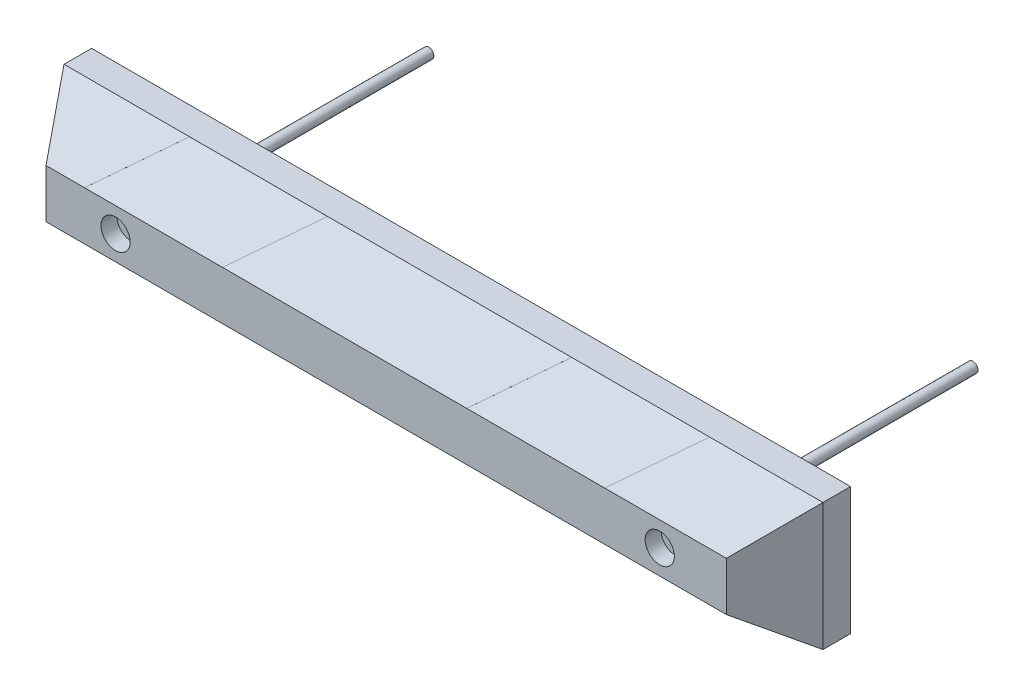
ISO-10303-21;
HEADER;
FILE_DESCRIPTION(('STEP AP214'),'2;1');
FILE_NAME('part.step','',(''),(''),'','','');
FILE_SCHEMA(('AUTOMOTIVE_DESIGN { 1 0 10303 214 1 1 1 1 }'));
ENDSEC;
DATA;
#1=APPLICATION_CONTEXT('core data for automotive mechanical design processes');
#2=APPLICATION_PROTOCOL_DEFINITION('international standard','automotive_design',2000,#1);
#3=PRODUCT_CONTEXT('',#1,'mechanical');
#4=PRODUCT('Part','Part','',(#3));
#5=PRODUCT_RELATED_PRODUCT_CATEGORY('part','',(#4));
#6=PRODUCT_DEFINITION_FORMATION('','',#4);
#7=PRODUCT_DEFINITION_CONTEXT('part definition',#1,'design');
#8=PRODUCT_DEFINITION('design','',#6,#7);
#9=PRODUCT_DEFINITION_SHAPE('','',#8);
#10=(LENGTH_UNIT() NAMED_UNIT(*) SI_UNIT(.MILLI.,.METRE.));
#11=(NAMED_UNIT(*) PLANE_ANGLE_UNIT() SI_UNIT($,.RADIAN.));
#12=(NAMED_UNIT(*) SI_UNIT($,.STERADIAN.) SOLID_ANGLE_UNIT());
#13=UNCERTAINTY_MEASURE_WITH_UNIT(LENGTH_MEASURE(1.E-05),#10,'distance_accuracy_value','');
#14=(GEOMETRIC_REPRESENTATION_CONTEXT(3) GLOBAL_UNCERTAINTY_ASSIGNED_CONTEXT((#13)) GLOBAL_UNIT_ASSIGNED_CONTEXT((#10,
#11,#12)) REPRESENTATION_CONTEXT('',''));
#15=CARTESIAN_POINT('',(0.,0.,0.));
#16=DIRECTION('',(0.,0.,1.));
#17=DIRECTION('',(1.,0.,0.));
#18=AXIS2_PLACEMENT_3D('',#15,#16,#17);
#19=CARTESIAN_POINT('',(0.,0.,0.));
#20=DIRECTION('',(0.,0.,1.));
#21=DIRECTION('',(1.,0.,0.));
#22=AXIS2_PLACEMENT_3D('',#19,#20,#21);
#23=PLANE('',#22);
#24=CARTESIAN_POINT('',(-323.723,0.,0.));
#25=DIRECTION('',(0.,0.,1.));
#26=DIRECTION('',(1.,0.,0.));
#27=AXIS2_PLACEMENT_3D('',#24,#25,#26);
#28=CIRCLE('',#27,16.7448960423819);
#29=CARTESIAN_POINT('',(-306.978103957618,0.,0.));
#30=VERTEX_POINT('',#29);
#31=EDGE_CURVE('E405',#30,#30,#28,.F.);
#32=ORIENTED_EDGE('',*,*,#31,.F.);
#33=EDGE_LOOP('',(#32));
#34=FACE_BOUND('',#33,.T.);
#35=DIRECTION('',(0.,-1.,0.));
#36=VECTOR('',#35,1.);
#37=CARTESIAN_POINT('',(-454.025,76.2,0.));
#38=LINE('',#37,#36);
#39=CARTESIAN_POINT('',(-454.025,76.2,0.));
#40=VERTEX_POINT('',#39);
#41=CARTESIAN_POINT('',(-454.025,-76.2,0.));
#42=VERTEX_POINT('',#41);
#43=EDGE_CURVE('E345',#40,#42,#38,.T.);
#44=ORIENTED_EDGE('',*,*,#43,.F.);
#45=DIRECTION('',(-1.,0.,0.));
#46=VECTOR('',#45,1.);
#47=CARTESIAN_POINT('',(-454.025,76.2,0.));
#48=LINE('',#47,#46);
#49=CARTESIAN_POINT('',(454.025,76.2,0.));
#50=VERTEX_POINT('',#49);
#51=EDGE_CURVE('E373',#50,#40,#48,.T.);
#52=ORIENTED_EDGE('',*,*,#51,.F.);
#53=DIRECTION('',(0.,1.,0.));
#54=VECTOR('',#53,1.);
#55=CARTESIAN_POINT('',(454.025,76.2,0.));
#56=LINE('',#55,#54);
#57=CARTESIAN_POINT('',(454.025,-76.2,0.));
#58=VERTEX_POINT('',#57);
#59=EDGE_CURVE('E391',#58,#50,#56,.T.);
#60=ORIENTED_EDGE('',*,*,#59,.F.);
#61=DIRECTION('',(1.,0.,0.));
#62=VECTOR('',#61,1.);
#63=CARTESIAN_POINT('',(-454.025,-76.2,0.));
#64=LINE('',#63,#62);
#65=EDGE_CURVE('E389',#42,#58,#64,.T.);
#66=ORIENTED_EDGE('',*,*,#65,.F.);
#67=EDGE_LOOP('',(#44,#52,#60,#66));
#68=FACE_BOUND('',#67,.T.);
#69=CARTESIAN_POINT('',(327.279,0.,0.));
#70=DIRECTION('',(0.,0.,1.));
#71=DIRECTION('',(1.,0.,0.));
#72=AXIS2_PLACEMENT_3D('',#69,#70,#71);
#73=CIRCLE('',#72,16.7448960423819);
#74=CARTESIAN_POINT('',(344.023896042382,0.,0.));
#75=VERTEX_POINT('',#74);
#76=EDGE_CURVE('E411',#75,#75,#73,.F.);
#77=ORIENTED_EDGE('',*,*,#76,.F.);
#78=EDGE_LOOP('',(#77));
#79=FACE_BOUND('',#78,.T.);
#80=ADVANCED_FACE('F35',(#34,#68,#79),#23,.F.);
#81=CARTESIAN_POINT('',(-454.025,76.2,33.02));
#82=DIRECTION('',(0.,0.824620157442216,0.565686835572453));
#83=DIRECTION('',(0.,-0.565686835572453,0.824620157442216));
#84=AXIS2_PLACEMENT_3D('',#81,#82,#83);
#85=PLANE('',#84);
#86=DIRECTION('',(-0.56568683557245,-0.466476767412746,0.679998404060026));
#87=VECTOR('',#86,1.);
#88=CARTESIAN_POINT('',(261.428614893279,29.1543356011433,101.6));
#89=LINE('',#88,#87);
#90=CARTESIAN_POINT('',(318.479929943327,76.2,33.02));
#91=VERTEX_POINT('',#90);
#92=CARTESIAN_POINT('',(261.428614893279,29.1543356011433,101.6));
#93=VERTEX_POINT('',#92);
#94=EDGE_CURVE('E208',#91,#93,#89,.T.);
#95=ORIENTED_EDGE('',*,*,#94,.T.);
#96=DIRECTION('',(1.,0.,0.));
#97=VECTOR('',#96,1.);
#98=CARTESIAN_POINT('',(-454.025,29.1543356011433,101.6));
#99=LINE('',#98,#97);
#100=CARTESIAN_POINT('',(406.979335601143,29.1543356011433,101.6));
#101=VERTEX_POINT('',#100);
#102=EDGE_CURVE('E351',#101,#93,#99,.F.);
#103=ORIENTED_EDGE('',*,*,#102,.F.);
#104=DIRECTION('',(0.492366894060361,0.492366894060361,-0.717739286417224));
#105=VECTOR('',#104,1.);
#106=CARTESIAN_POINT('',(233.890834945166,-143.934165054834,353.91675493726));
#107=LINE('',#106,#105);
#108=CARTESIAN_POINT('',(454.025,76.2,33.02));
#109=VERTEX_POINT('',#108);
#110=EDGE_CURVE('E350',#101,#109,#107,.T.);
#111=ORIENTED_EDGE('',*,*,#110,.T.);
#112=DIRECTION('',(-1.,0.,0.));
#113=VECTOR('',#112,1.);
#114=CARTESIAN_POINT('',(-454.025,76.2,33.02));
#115=LINE('',#114,#113);
#116=EDGE_CURVE('E382',#109,#91,#115,.T.);
#117=ORIENTED_EDGE('',*,*,#116,.T.);
#118=EDGE_LOOP('',(#95,#103,#111,#117));
#119=FACE_BOUND('',#118,.T.);
#120=ADVANCED_FACE('F451',(#119),#85,.T.);
#121=DIRECTION('',(0.565686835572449,0.466476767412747,-0.679998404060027));
#122=VECTOR('',#121,1.);
#123=CARTESIAN_POINT('',(96.3286148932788,29.1543356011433,101.6));
#124=LINE('',#123,#122);
#125=CARTESIAN_POINT('',(96.3286148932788,29.1543356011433,101.6));
#126=VERTEX_POINT('',#125);
#127=CARTESIAN_POINT('',(153.379929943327,76.2,33.02));
#128=VERTEX_POINT('',#127);
#129=EDGE_CURVE('E51',#126,#128,#124,.T.);
#130=ORIENTED_EDGE('',*,*,#129,.T.);
#131=CARTESIAN_POINT('',(-138.720070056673,76.2,33.02));
#132=VERTEX_POINT('',#131);
#133=EDGE_CURVE('E386',#128,#132,#115,.T.);
#134=ORIENTED_EDGE('',*,*,#133,.T.);
#135=DIRECTION('',(-0.565686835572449,-0.466476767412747,0.679998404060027));
#136=VECTOR('',#135,1.);
#137=CARTESIAN_POINT('',(-195.771385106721,29.1543356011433,101.6));
#138=LINE('',#137,#136);
#139=CARTESIAN_POINT('',(-195.771385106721,29.1543356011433,101.6));
#140=VERTEX_POINT('',#139);
#141=EDGE_CURVE('E243',#132,#140,#138,.T.);
#142=ORIENTED_EDGE('',*,*,#141,.T.);
#143=EDGE_CURVE('E368',#126,#140,#99,.F.);
#144=ORIENTED_EDGE('',*,*,#143,.F.);
#145=EDGE_LOOP('',(#130,#134,#142,#144));
#146=FACE_BOUND('',#145,.T.);
#147=ADVANCED_FACE('F457',(#146),#85,.T.);
#148=DIRECTION('',(0.565686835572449,0.466476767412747,-0.679998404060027));
#149=VECTOR('',#148,1.);
#150=CARTESIAN_POINT('',(-303.820070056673,76.2,33.02));
#151=LINE('',#150,#149);
#152=CARTESIAN_POINT('',(-360.871385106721,29.1543356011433,101.6));
#153=VERTEX_POINT('',#152);
#154=CARTESIAN_POINT('',(-303.820070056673,76.2,33.02));
#155=VERTEX_POINT('',#154);
#156=EDGE_CURVE('E59',#153,#155,#151,.T.);
#157=ORIENTED_EDGE('',*,*,#156,.T.);
#158=CARTESIAN_POINT('',(-454.025,76.2,33.02));
#159=VERTEX_POINT('',#158);
#160=EDGE_CURVE('E381',#155,#159,#115,.T.);
#161=ORIENTED_EDGE('',*,*,#160,.T.);
#162=DIRECTION('',(-0.492366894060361,0.492366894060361,-0.717739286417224));
#163=VECTOR('',#162,1.);
#164=CARTESIAN_POINT('',(-454.025,76.2,33.02));
#165=LINE('',#164,#163);
#166=CARTESIAN_POINT('',(-406.979335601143,29.1543356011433,101.6));
#167=VERTEX_POINT('',#166);
#168=EDGE_CURVE('E347',#167,#159,#165,.T.);
#169=ORIENTED_EDGE('',*,*,#168,.F.);
#170=EDGE_CURVE('E365',#153,#167,#99,.F.);
#171=ORIENTED_EDGE('',*,*,#170,.F.);
#172=EDGE_LOOP('',(#157,#161,#169,#171));
#173=FACE_BOUND('',#172,.T.);
#174=ADVANCED_FACE('F460',(#173),#85,.T.);
#175=CARTESIAN_POINT('',(-454.025,-76.2,33.02));
#176=DIRECTION('',(0.,-0.824620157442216,0.565686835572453));
#177=DIRECTION('',(0.,-0.565686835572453,-0.824620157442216));
#178=AXIS2_PLACEMENT_3D('',#175,#176,#177);
#179=PLANE('',#178);
#180=DIRECTION('',(1.,0.,0.));
#181=VECTOR('',#180,1.);
#182=CARTESIAN_POINT('',(-454.025,-76.2,33.02));
#183=LINE('',#182,#181);
#184=CARTESIAN_POINT('',(-138.720070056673,-76.2,33.02));
#185=VERTEX_POINT('',#184);
#186=CARTESIAN_POINT('',(153.379929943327,-76.2,33.02));
#187=VERTEX_POINT('',#186);
#188=EDGE_CURVE('E378',#185,#187,#183,.T.);
#189=ORIENTED_EDGE('',*,*,#188,.T.);
#190=DIRECTION('',(0.565686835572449,-0.466476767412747,-0.679998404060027));
#191=VECTOR('',#190,1.);
#192=CARTESIAN_POINT('',(96.3286148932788,-29.1543356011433,101.6));
#193=LINE('',#192,#191);
#194=CARTESIAN_POINT('',(96.3286148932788,-29.1543356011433,101.6));
#195=VERTEX_POINT('',#194);
#196=EDGE_CURVE('E262',#195,#187,#193,.T.);
#197=ORIENTED_EDGE('',*,*,#196,.F.);
#198=DIRECTION('',(-1.,0.,0.));
#199=VECTOR('',#198,1.);
#200=CARTESIAN_POINT('',(-454.025,-29.1543356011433,101.6));
#201=LINE('',#200,#199);
#202=CARTESIAN_POINT('',(-195.771385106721,-29.1543356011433,101.6));
#203=VERTEX_POINT('',#202);
#204=EDGE_CURVE('E363',#203,#195,#201,.F.);
#205=ORIENTED_EDGE('',*,*,#204,.F.);
#206=DIRECTION('',(-0.565686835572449,0.466476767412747,0.679998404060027));
#207=VECTOR('',#206,1.);
#208=CARTESIAN_POINT('',(-195.771385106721,-29.1543356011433,101.6));
#209=LINE('',#208,#207);
#210=EDGE_CURVE('E309',#185,#203,#209,.T.);
#211=ORIENTED_EDGE('',*,*,#210,.F.);
#212=EDGE_LOOP('',(#189,#197,#205,#211));
#213=FACE_BOUND('',#212,.T.);
#214=ADVANCED_FACE('F541',(#213),#179,.T.);
#215=CARTESIAN_POINT('',(-454.025,-76.2,33.02));
#216=VERTEX_POINT('',#215);
#217=CARTESIAN_POINT('',(-303.820070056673,-76.2,33.02));
#218=VERTEX_POINT('',#217);
#219=EDGE_CURVE('E374',#216,#218,#183,.T.);
#220=ORIENTED_EDGE('',*,*,#219,.T.);
#221=DIRECTION('',(0.565686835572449,-0.466476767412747,-0.679998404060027));
#222=VECTOR('',#221,1.);
#223=CARTESIAN_POINT('',(-303.820070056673,-76.2,33.02));
#224=LINE('',#223,#222);
#225=CARTESIAN_POINT('',(-360.871385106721,-29.1543356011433,101.6));
#226=VERTEX_POINT('',#225);
#227=EDGE_CURVE('E283',#226,#218,#224,.T.);
#228=ORIENTED_EDGE('',*,*,#227,.F.);
#229=CARTESIAN_POINT('',(-406.979335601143,-29.1543356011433,101.6));
#230=VERTEX_POINT('',#229);
#231=EDGE_CURVE('E359',#230,#226,#201,.F.);
#232=ORIENTED_EDGE('',*,*,#231,.F.);
#233=DIRECTION('',(-0.492366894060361,-0.492366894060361,-0.717739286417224));
#234=VECTOR('',#233,1.);
#235=CARTESIAN_POINT('',(-454.025,-76.2,33.02));
#236=LINE('',#235,#234);
#237=EDGE_CURVE('E342',#230,#216,#236,.T.);
#238=ORIENTED_EDGE('',*,*,#237,.T.);
#239=EDGE_LOOP('',(#220,#228,#232,#238));
#240=FACE_BOUND('',#239,.T.);
#241=ADVANCED_FACE('F562',(#240),#179,.T.);
#242=CARTESIAN_POINT('',(327.279,0.,0.));
#243=DIRECTION('',(0.,0.,1.));
#244=DIRECTION('',(1.,0.,0.));
#245=AXIS2_PLACEMENT_3D('',#242,#243,#244);
#246=CYLINDRICAL_SURFACE('',#245,7.93749999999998);
#247=CARTESIAN_POINT('',(327.279,0.,0.));
#248=DIRECTION('',(0.,0.,1.));
#249=DIRECTION('',(1.,0.,0.));
#250=AXIS2_PLACEMENT_3D('',#247,#248,#249);
#251=CIRCLE('',#250,7.93749999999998);
#252=CARTESIAN_POINT('',(335.2165,0.,0.));
#253=VERTEX_POINT('',#252);
#254=EDGE_CURVE('E335',#253,#253,#251,.T.);
#255=ORIENTED_EDGE('',*,*,#254,.F.);
#256=EDGE_LOOP('',(#255));
#257=FACE_BOUND('',#256,.T.);
#258=CARTESIAN_POINT('',(327.279,0.,82.55));
#259=DIRECTION('',(0.,0.,1.));
#260=DIRECTION('',(1.,0.,0.));
#261=AXIS2_PLACEMENT_3D('',#258,#259,#260);
#262=CIRCLE('',#261,7.93749999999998);
#263=CARTESIAN_POINT('',(335.2165,0.,82.55));
#264=VERTEX_POINT('',#263);
#265=EDGE_CURVE('E325',#264,#264,#262,.F.);
#266=ORIENTED_EDGE('',*,*,#265,.F.);
#267=EDGE_LOOP('',(#266));
#268=FACE_BOUND('',#267,.T.);
#269=ADVANCED_FACE('F601',(#257,#268),#246,.F.);
#270=CARTESIAN_POINT('',(-323.723,0.,0.));
#271=DIRECTION('',(0.,0.,1.));
#272=DIRECTION('',(1.,0.,0.));
#273=AXIS2_PLACEMENT_3D('',#270,#271,#272);
#274=CYLINDRICAL_SURFACE('',#273,7.9375000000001);
#275=CARTESIAN_POINT('',(-323.723,0.,0.));
#276=DIRECTION('',(0.,0.,1.));
#277=DIRECTION('',(1.,0.,0.));
#278=AXIS2_PLACEMENT_3D('',#275,#276,#277);
#279=CIRCLE('',#278,7.9375000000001);
#280=CARTESIAN_POINT('',(-315.7855,0.,0.));
#281=VERTEX_POINT('',#280);
#282=EDGE_CURVE('E338',#281,#281,#279,.T.);
#283=ORIENTED_EDGE('',*,*,#282,.F.);
#284=EDGE_LOOP('',(#283));
#285=FACE_BOUND('',#284,.T.);
#286=CARTESIAN_POINT('',(-323.723,0.,82.55));
#287=DIRECTION('',(0.,0.,1.));
#288=DIRECTION('',(1.,0.,0.));
#289=AXIS2_PLACEMENT_3D('',#286,#287,#288);
#290=CIRCLE('',#289,7.9375000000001);
#291=CARTESIAN_POINT('',(-315.7855,0.,82.55));
#292=VERTEX_POINT('',#291);
#293=EDGE_CURVE('E331',#292,#292,#290,.F.);
#294=ORIENTED_EDGE('',*,*,#293,.F.);
#295=EDGE_LOOP('',(#294));
#296=FACE_BOUND('',#295,.T.);
#297=ADVANCED_FACE('F481',(#285,#296),#274,.F.);
#298=CARTESIAN_POINT('',(-454.025,76.2,33.02));
#299=DIRECTION('',(1.,0.,0.));
#300=DIRECTION('',(0.,0.,-1.));
#301=AXIS2_PLACEMENT_3D('',#298,#299,#300);
#302=PLANE('',#301);
#303=ORIENTED_EDGE('',*,*,#43,.T.);
#304=DIRECTION('',(0.,0.,-1.));
#305=VECTOR('',#304,1.);
#306=CARTESIAN_POINT('',(-454.025,-76.2,33.02));
#307=LINE('',#306,#305);
#308=EDGE_CURVE('E402',#216,#42,#307,.T.);
#309=ORIENTED_EDGE('',*,*,#308,.F.);
#310=DIRECTION('',(0.,-1.,0.));
#311=VECTOR('',#310,1.);
#312=CARTESIAN_POINT('',(-454.025,76.2,33.02));
#313=LINE('',#312,#311);
#314=EDGE_CURVE('E369',#159,#216,#313,.T.);
#315=ORIENTED_EDGE('',*,*,#314,.F.);
#316=DIRECTION('',(0.,0.,-1.));
#317=VECTOR('',#316,1.);
#318=CARTESIAN_POINT('',(-454.025,76.2,33.02));
#319=LINE('',#318,#317);
#320=EDGE_CURVE('E385',#159,#40,#319,.T.);
#321=ORIENTED_EDGE('',*,*,#320,.T.);
#322=EDGE_LOOP('',(#303,#309,#315,#321));
#323=FACE_BOUND('',#322,.T.);
#324=ADVANCED_FACE('F37',(#323),#302,.F.);
#325=CARTESIAN_POINT('',(-454.025,-76.2,33.02));
#326=DIRECTION('',(0.,1.,0.));
#327=DIRECTION('',(0.,0.,1.));
#328=AXIS2_PLACEMENT_3D('',#325,#326,#327);
#329=PLANE('',#328);
#330=ORIENTED_EDGE('',*,*,#65,.T.);
#331=DIRECTION('',(0.,0.,-1.));
#332=VECTOR('',#331,1.);
#333=CARTESIAN_POINT('',(454.025,-76.2,33.02));
#334=LINE('',#333,#332);
#335=CARTESIAN_POINT('',(454.025,-76.2,33.02));
#336=VERTEX_POINT('',#335);
#337=EDGE_CURVE('E399',#336,#58,#334,.T.);
#338=ORIENTED_EDGE('',*,*,#337,.F.);
#339=CARTESIAN_POINT('',(318.479929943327,-76.2,33.02));
#340=VERTEX_POINT('',#339);
#341=EDGE_CURVE('E372',#340,#336,#183,.T.);
#342=ORIENTED_EDGE('',*,*,#341,.F.);
#343=DIRECTION('',(1.,0.,0.));
#344=VECTOR('',#343,1.);
#345=CARTESIAN_POINT('',(318.479929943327,-76.2,33.02));
#346=LINE('',#345,#344);
#347=EDGE_CURVE('E250',#187,#340,#346,.T.);
#348=ORIENTED_EDGE('',*,*,#347,.F.);
#349=ORIENTED_EDGE('',*,*,#188,.F.);
#350=DIRECTION('',(1.,0.,0.));
#351=VECTOR('',#350,1.);
#352=CARTESIAN_POINT('',(-138.720070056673,-76.2,33.02));
#353=LINE('',#352,#351);
#354=EDGE_CURVE('E306',#218,#185,#353,.T.);
#355=ORIENTED_EDGE('',*,*,#354,.F.);
#356=ORIENTED_EDGE('',*,*,#219,.F.);
#357=ORIENTED_EDGE('',*,*,#308,.T.);
#358=EDGE_LOOP('',(#330,#338,#342,#348,#349,#355,#356,#357));
#359=FACE_BOUND('',#358,.T.);
#360=ADVANCED_FACE('F474',(#359),#329,.F.);
#361=CARTESIAN_POINT('',(454.025,76.2,33.02));
#362=DIRECTION('',(-1.,0.,0.));
#363=DIRECTION('',(0.,0.,1.));
#364=AXIS2_PLACEMENT_3D('',#361,#362,#363);
#365=PLANE('',#364);
#366=ORIENTED_EDGE('',*,*,#59,.T.);
#367=DIRECTION('',(0.,0.,-1.));
#368=VECTOR('',#367,1.);
#369=CARTESIAN_POINT('',(454.025,76.2,33.02));
#370=LINE('',#369,#368);
#371=EDGE_CURVE('E396',#109,#50,#370,.T.);
#372=ORIENTED_EDGE('',*,*,#371,.F.);
#373=DIRECTION('',(0.,1.,0.));
#374=VECTOR('',#373,1.);
#375=CARTESIAN_POINT('',(454.025,76.2,33.02));
#376=LINE('',#375,#374);
#377=EDGE_CURVE('E377',#336,#109,#376,.T.);
#378=ORIENTED_EDGE('',*,*,#377,.F.);
#379=ORIENTED_EDGE('',*,*,#337,.T.);
#380=EDGE_LOOP('',(#366,#372,#378,#379));
#381=FACE_BOUND('',#380,.T.);
#382=ADVANCED_FACE('F471',(#381),#365,.F.);
#383=CARTESIAN_POINT('',(-454.025,76.2,33.02));
#384=DIRECTION('',(0.,-1.,0.));
#385=DIRECTION('',(0.,0.,-1.));
#386=AXIS2_PLACEMENT_3D('',#383,#384,#385);
#387=PLANE('',#386);
#388=ORIENTED_EDGE('',*,*,#51,.T.);
#389=ORIENTED_EDGE('',*,*,#320,.F.);
#390=ORIENTED_EDGE('',*,*,#160,.F.);
#391=DIRECTION('',(1.,0.,0.));
#392=VECTOR('',#391,1.);
#393=CARTESIAN_POINT('',(-138.720070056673,76.2,33.02));
#394=LINE('',#393,#392);
#395=EDGE_CURVE('E232',#155,#132,#394,.T.);
#396=ORIENTED_EDGE('',*,*,#395,.T.);
#397=ORIENTED_EDGE('',*,*,#133,.F.);
#398=DIRECTION('',(1.,0.,0.));
#399=VECTOR('',#398,1.);
#400=CARTESIAN_POINT('',(318.479929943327,76.2,33.02));
#401=LINE('',#400,#399);
#402=EDGE_CURVE('E204',#128,#91,#401,.T.);
#403=ORIENTED_EDGE('',*,*,#402,.T.);
#404=ORIENTED_EDGE('',*,*,#116,.F.);
#405=ORIENTED_EDGE('',*,*,#371,.T.);
#406=EDGE_LOOP('',(#388,#389,#390,#396,#397,#403,#404,#405));
#407=FACE_BOUND('',#406,.T.);
#408=ADVANCED_FACE('F467',(#407),#387,.F.);
#409=CARTESIAN_POINT('',(-454.025,76.2,33.02));
#410=DIRECTION('',(-0.824620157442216,0.,0.565686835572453));
#411=DIRECTION('',(0.565686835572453,0.,0.824620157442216));
#412=AXIS2_PLACEMENT_3D('',#409,#410,#411);
#413=PLANE('',#412);
#414=ORIENTED_EDGE('',*,*,#314,.T.);
#415=ORIENTED_EDGE('',*,*,#237,.F.);
#416=DIRECTION('',(0.,1.,0.));
#417=VECTOR('',#416,1.);
#418=CARTESIAN_POINT('',(-406.979335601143,76.2,101.6));
#419=LINE('',#418,#417);
#420=EDGE_CURVE('E341',#167,#230,#419,.F.);
#421=ORIENTED_EDGE('',*,*,#420,.F.);
#422=ORIENTED_EDGE('',*,*,#168,.T.);
#423=EDGE_LOOP('',(#414,#415,#421,#422));
#424=FACE_BOUND('',#423,.T.);
#425=ADVANCED_FACE('F470',(#424),#413,.T.);
#426=CARTESIAN_POINT('',(261.428614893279,-29.1543356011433,101.6));
#427=VERTEX_POINT('',#426);
#428=CARTESIAN_POINT('',(406.979335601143,-29.1543356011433,101.6));
#429=VERTEX_POINT('',#428);
#430=EDGE_CURVE('E358',#427,#429,#201,.F.);
#431=ORIENTED_EDGE('',*,*,#430,.F.);
#432=DIRECTION('',(-0.56568683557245,0.466476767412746,0.679998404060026));
#433=VECTOR('',#432,1.);
#434=CARTESIAN_POINT('',(261.428614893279,-29.1543356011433,101.6));
#435=LINE('',#434,#433);
#436=EDGE_CURVE('E274',#340,#427,#435,.T.);
#437=ORIENTED_EDGE('',*,*,#436,.F.);
#438=ORIENTED_EDGE('',*,*,#341,.T.);
#439=DIRECTION('',(0.492366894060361,-0.492366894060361,-0.717739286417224));
#440=VECTOR('',#439,1.);
#441=CARTESIAN_POINT('',(417.079405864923,-39.254405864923,86.8767980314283));
#442=LINE('',#441,#440);
#443=EDGE_CURVE('E346',#429,#336,#442,.T.);
#444=ORIENTED_EDGE('',*,*,#443,.F.);
#445=EDGE_LOOP('',(#431,#437,#438,#444));
#446=FACE_BOUND('',#445,.T.);
#447=ADVANCED_FACE('F465',(#446),#179,.T.);
#448=CARTESIAN_POINT('',(454.025,76.2,33.02));
#449=DIRECTION('',(0.824620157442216,0.,0.565686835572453));
#450=DIRECTION('',(0.565686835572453,0.,-0.824620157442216));
#451=AXIS2_PLACEMENT_3D('',#448,#449,#450);
#452=PLANE('',#451);
#453=ORIENTED_EDGE('',*,*,#377,.T.);
#454=ORIENTED_EDGE('',*,*,#110,.F.);
#455=DIRECTION('',(0.,-1.,0.));
#456=VECTOR('',#455,1.);
#457=CARTESIAN_POINT('',(406.979335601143,76.2,101.6));
#458=LINE('',#457,#456);
#459=EDGE_CURVE('E362',#429,#101,#458,.F.);
#460=ORIENTED_EDGE('',*,*,#459,.F.);
#461=ORIENTED_EDGE('',*,*,#443,.T.);
#462=EDGE_LOOP('',(#453,#454,#460,#461));
#463=FACE_BOUND('',#462,.T.);
#464=ADVANCED_FACE('F528',(#463),#452,.T.);
#465=CARTESIAN_POINT('',(0.,0.,101.6));
#466=DIRECTION('',(0.,0.,1.));
#467=DIRECTION('',(1.,0.,0.));
#468=AXIS2_PLACEMENT_3D('',#465,#466,#467);
#469=PLANE('',#468);
#470=CARTESIAN_POINT('',(327.279,0.,101.6));
#471=DIRECTION('',(0.,0.,1.));
#472=DIRECTION('',(1.,0.,0.));
#473=AXIS2_PLACEMENT_3D('',#470,#471,#472);
#474=CIRCLE('',#473,17.4625);
#475=CARTESIAN_POINT('',(344.7415,0.,101.6));
#476=VERTEX_POINT('',#475);
#477=EDGE_CURVE('E315',#476,#476,#474,.T.);
#478=ORIENTED_EDGE('',*,*,#477,.F.);
#479=EDGE_LOOP('',(#478));
#480=FACE_BOUND('',#479,.T.);
#481=CARTESIAN_POINT('',(-323.723,0.,101.6));
#482=DIRECTION('',(0.,0.,1.));
#483=DIRECTION('',(1.,0.,0.));
#484=AXIS2_PLACEMENT_3D('',#481,#482,#483);
#485=CIRCLE('',#484,17.4625);
#486=CARTESIAN_POINT('',(-306.2605,0.,101.6));
#487=VERTEX_POINT('',#486);
#488=EDGE_CURVE('E332',#487,#487,#485,.T.);
#489=ORIENTED_EDGE('',*,*,#488,.F.);
#490=EDGE_LOOP('',(#489));
#491=FACE_BOUND('',#490,.T.);
#492=ORIENTED_EDGE('',*,*,#420,.T.);
#493=ORIENTED_EDGE('',*,*,#231,.T.);
#494=DIRECTION('',(-1.,0.,0.));
#495=VECTOR('',#494,1.);
#496=CARTESIAN_POINT('',(-360.871385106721,-29.1543356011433,101.6));
#497=LINE('',#496,#495);
#498=EDGE_CURVE('E294',#203,#226,#497,.T.);
#499=ORIENTED_EDGE('',*,*,#498,.F.);
#500=ORIENTED_EDGE('',*,*,#204,.T.);
#501=DIRECTION('',(-1.,0.,0.));
#502=VECTOR('',#501,1.);
#503=CARTESIAN_POINT('',(96.3286148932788,-29.1543356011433,101.6));
#504=LINE('',#503,#502);
#505=EDGE_CURVE('E276',#427,#195,#504,.T.);
#506=ORIENTED_EDGE('',*,*,#505,.F.);
#507=ORIENTED_EDGE('',*,*,#430,.T.);
#508=ORIENTED_EDGE('',*,*,#459,.T.);
#509=ORIENTED_EDGE('',*,*,#102,.T.);
#510=DIRECTION('',(-1.,0.,0.));
#511=VECTOR('',#510,1.);
#512=CARTESIAN_POINT('',(96.3286148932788,29.1543356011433,101.6));
#513=LINE('',#512,#511);
#514=EDGE_CURVE('E211',#93,#126,#513,.T.);
#515=ORIENTED_EDGE('',*,*,#514,.T.);
#516=ORIENTED_EDGE('',*,*,#143,.T.);
#517=DIRECTION('',(-1.,0.,0.));
#518=VECTOR('',#517,1.);
#519=CARTESIAN_POINT('',(-360.871385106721,29.1543356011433,101.6));
#520=LINE('',#519,#518);
#521=EDGE_CURVE('E240',#140,#153,#520,.T.);
#522=ORIENTED_EDGE('',*,*,#521,.T.);
#523=ORIENTED_EDGE('',*,*,#170,.T.);
#524=EDGE_LOOP('',(#492,#493,#499,#500,#506,#507,#508,#509,#515,#516,#522,#523));
#525=FACE_BOUND('',#524,.T.);
#526=ADVANCED_FACE('F518',(#480,#491,#525),#469,.T.);
#527=CARTESIAN_POINT('',(-323.723,0.,82.55));
#528=DIRECTION('',(0.,0.,1.));
#529=DIRECTION('',(1.,0.,0.));
#530=AXIS2_PLACEMENT_3D('',#527,#528,#529);
#531=PLANE('',#530);
#532=CARTESIAN_POINT('',(-323.723,0.,82.55));
#533=DIRECTION('',(0.,0.,1.));
#534=DIRECTION('',(1.,0.,0.));
#535=AXIS2_PLACEMENT_3D('',#532,#533,#534);
#536=CIRCLE('',#535,17.4625);
#537=CARTESIAN_POINT('',(-306.2605,0.,82.55));
#538=VERTEX_POINT('',#537);
#539=EDGE_CURVE('E328',#538,#538,#536,.T.);
#540=ORIENTED_EDGE('',*,*,#539,.T.);
#541=EDGE_LOOP('',(#540));
#542=FACE_BOUND('',#541,.T.);
#543=ORIENTED_EDGE('',*,*,#293,.T.);
#544=EDGE_LOOP('',(#543));
#545=FACE_BOUND('',#544,.T.);
#546=ADVANCED_FACE('F594',(#542,#545),#531,.T.);
#547=CARTESIAN_POINT('',(-323.723,0.,82.55));
#548=DIRECTION('',(0.,0.,1.));
#549=DIRECTION('',(1.,0.,0.));
#550=AXIS2_PLACEMENT_3D('',#547,#548,#549);
#551=CYLINDRICAL_SURFACE('',#550,17.4625);
#552=CARTESIAN_POINT('',(-306.2605,0.,82.55));
#553=CARTESIAN_POINT('',(-306.2605,0.,82.7484375));
#554=CARTESIAN_POINT('',(-306.2605,0.,82.946875));
#555=CARTESIAN_POINT('',(-306.2605,0.,83.34375));
#556=CARTESIAN_POINT('',(-306.2605,0.,83.5421875));
#557=CARTESIAN_POINT('',(-306.2605,0.,83.9390625));
#558=CARTESIAN_POINT('',(-306.2605,0.,84.1375));
#559=CARTESIAN_POINT('',(-306.2605,0.,84.534375));
#560=CARTESIAN_POINT('',(-306.2605,0.,84.7328125));
#561=CARTESIAN_POINT('',(-306.2605,0.,85.1296875));
#562=CARTESIAN_POINT('',(-306.2605,0.,85.328125));
#563=CARTESIAN_POINT('',(-306.2605,0.,85.725));
#564=CARTESIAN_POINT('',(-306.2605,0.,85.9234375));
#565=CARTESIAN_POINT('',(-306.2605,0.,86.3203125));
#566=CARTESIAN_POINT('',(-306.2605,0.,86.51875));
#567=CARTESIAN_POINT('',(-306.2605,0.,86.915625));
#568=CARTESIAN_POINT('',(-306.2605,0.,87.1140625));
#569=CARTESIAN_POINT('',(-306.2605,0.,87.5109375));
#570=CARTESIAN_POINT('',(-306.2605,0.,87.709375));
#571=CARTESIAN_POINT('',(-306.2605,0.,88.10625));
#572=CARTESIAN_POINT('',(-306.2605,0.,88.3046875));
#573=CARTESIAN_POINT('',(-306.2605,0.,88.7015625));
#574=CARTESIAN_POINT('',(-306.2605,0.,88.9));
#575=CARTESIAN_POINT('',(-306.2605,0.,89.296875));
#576=CARTESIAN_POINT('',(-306.2605,0.,89.4953125));
#577=CARTESIAN_POINT('',(-306.2605,0.,89.8921875));
#578=CARTESIAN_POINT('',(-306.2605,0.,90.090625));
#579=CARTESIAN_POINT('',(-306.2605,0.,90.4875));
#580=CARTESIAN_POINT('',(-306.2605,0.,90.6859375));
#581=CARTESIAN_POINT('',(-306.2605,0.,91.0828125));
#582=CARTESIAN_POINT('',(-306.2605,0.,91.28125));
#583=CARTESIAN_POINT('',(-306.2605,0.,91.678125));
#584=CARTESIAN_POINT('',(-306.2605,0.,91.8765625));
#585=CARTESIAN_POINT('',(-306.2605,0.,92.2734375));
#586=CARTESIAN_POINT('',(-306.2605,0.,92.471875));
#587=CARTESIAN_POINT('',(-306.2605,0.,92.86875));
#588=CARTESIAN_POINT('',(-306.2605,0.,93.0671875));
#589=CARTESIAN_POINT('',(-306.2605,0.,93.4640625));
#590=CARTESIAN_POINT('',(-306.2605,0.,93.6625));
#591=CARTESIAN_POINT('',(-306.2605,0.,94.059375));
#592=CARTESIAN_POINT('',(-306.2605,0.,94.2578125));
#593=CARTESIAN_POINT('',(-306.2605,0.,94.6546875));
#594=CARTESIAN_POINT('',(-306.2605,0.,94.853125));
#595=CARTESIAN_POINT('',(-306.2605,0.,95.25));
#596=CARTESIAN_POINT('',(-306.2605,0.,95.4484375));
#597=CARTESIAN_POINT('',(-306.2605,0.,95.8453125));
#598=CARTESIAN_POINT('',(-306.2605,0.,96.04375));
#599=CARTESIAN_POINT('',(-306.2605,0.,96.440625));
#600=CARTESIAN_POINT('',(-306.2605,0.,96.6390625));
#601=CARTESIAN_POINT('',(-306.2605,0.,97.0359375));
#602=CARTESIAN_POINT('',(-306.2605,0.,97.234375));
#603=CARTESIAN_POINT('',(-306.2605,0.,97.63125));
#604=CARTESIAN_POINT('',(-306.2605,0.,97.8296875));
#605=CARTESIAN_POINT('',(-306.2605,0.,98.2265625));
#606=CARTESIAN_POINT('',(-306.2605,0.,98.425));
#607=CARTESIAN_POINT('',(-306.2605,0.,98.821875));
#608=CARTESIAN_POINT('',(-306.2605,0.,99.0203125));
#609=CARTESIAN_POINT('',(-306.2605,0.,99.4171875));
#610=CARTESIAN_POINT('',(-306.2605,0.,99.615625));
#611=CARTESIAN_POINT('',(-306.2605,0.,100.0125));
#612=CARTESIAN_POINT('',(-306.2605,0.,100.2109375));
#613=CARTESIAN_POINT('',(-306.2605,0.,100.6078125));
#614=CARTESIAN_POINT('',(-306.2605,0.,100.80625));
#615=CARTESIAN_POINT('',(-306.2605,0.,101.203125));
#616=CARTESIAN_POINT('',(-306.2605,0.,101.4015625));
#617=CARTESIAN_POINT('',(-306.2605,0.,101.6));
#618=B_SPLINE_CURVE_WITH_KNOTS('',3,(#552,#553,#554,#555,#556,#557,#558,#559,#560,#561,#562,
#563,#564,#565,#566,#567,#568,#569,#570,#571,#572,#573,#574,#575,#576,#577,#578,#579,#580,#581,
#582,#583,#584,#585,#586,#587,#588,#589,#590,#591,#592,#593,#594,#595,#596,#597,#598,#599,#600,
#601,#602,#603,#604,#605,#606,#607,#608,#609,#610,#611,#612,#613,#614,#615,#616,#617),
.UNSPECIFIED.,.F.,.F.,(4,2,2,2,2,2,2,2,2,2,2,2,2,2,2,2,2,2,2,2,2,2,2,2,2,2,2,2,2,2,2,2,4),(0.,
0.595312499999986,1.19062499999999,1.78593749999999,2.38124999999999,2.97656249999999,
3.57187499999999,4.16718749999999,4.76249999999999,5.35781249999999,5.95312499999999,
6.54843749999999,7.14374999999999,7.73906249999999,8.33437499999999,8.92968749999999,
9.52499999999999,10.1203125,10.715625,11.3109375,11.90625,12.5015625,13.096875,13.6921875,
14.2875,14.8828125,15.478125,16.0734375,16.66875,17.2640625,17.859375,18.4546875,19.05),.UNSPECIFIED.);
#619=EDGE_CURVE('BSEAM589',#538,#487,#618,.T.);
#620=ORIENTED_EDGE('',*,*,#539,.F.);
#621=ORIENTED_EDGE('',*,*,#488,.T.);
#622=ORIENTED_EDGE('',*,*,#619,.T.);
#623=ORIENTED_EDGE('',*,*,#619,.F.);
#624=EDGE_LOOP('',(#620,#622,#621,#623));
#625=FACE_BOUND('',#624,.T.);
#626=ADVANCED_FACE('F589',(#625),#551,.F.);
#627=CARTESIAN_POINT('',(327.279,0.,82.55));
#628=DIRECTION('',(0.,0.,1.));
#629=DIRECTION('',(1.,0.,0.));
#630=AXIS2_PLACEMENT_3D('',#627,#628,#629);
#631=PLANE('',#630);
#632=CARTESIAN_POINT('',(327.279,0.,82.55));
#633=DIRECTION('',(0.,0.,1.));
#634=DIRECTION('',(1.,0.,0.));
#635=AXIS2_PLACEMENT_3D('',#632,#633,#634);
#636=CIRCLE('',#635,17.4625);
#637=CARTESIAN_POINT('',(344.7415,0.,82.55));
#638=VERTEX_POINT('',#637);
#639=EDGE_CURVE('E322',#638,#638,#636,.T.);
#640=ORIENTED_EDGE('',*,*,#639,.T.);
#641=EDGE_LOOP('',(#640));
#642=FACE_BOUND('',#641,.T.);
#643=ORIENTED_EDGE('',*,*,#265,.T.);
#644=EDGE_LOOP('',(#643));
#645=FACE_BOUND('',#644,.T.);
#646=ADVANCED_FACE('F586',(#642,#645),#631,.T.);
#647=CARTESIAN_POINT('',(327.279,0.,82.55));
#648=DIRECTION('',(0.,0.,1.));
#649=DIRECTION('',(1.,0.,0.));
#650=AXIS2_PLACEMENT_3D('',#647,#648,#649);
#651=CYLINDRICAL_SURFACE('',#650,17.4625);
#652=CARTESIAN_POINT('',(344.7415,0.,82.55));
#653=CARTESIAN_POINT('',(344.7415,0.,82.7484375));
#654=CARTESIAN_POINT('',(344.7415,0.,82.946875));
#655=CARTESIAN_POINT('',(344.7415,0.,83.34375));
#656=CARTESIAN_POINT('',(344.7415,0.,83.5421875));
#657=CARTESIAN_POINT('',(344.7415,0.,83.9390625));
#658=CARTESIAN_POINT('',(344.7415,0.,84.1375));
#659=CARTESIAN_POINT('',(344.7415,0.,84.534375));
#660=CARTESIAN_POINT('',(344.7415,0.,84.7328125));
#661=CARTESIAN_POINT('',(344.7415,0.,85.1296875));
#662=CARTESIAN_POINT('',(344.7415,0.,85.328125));
#663=CARTESIAN_POINT('',(344.7415,0.,85.725));
#664=CARTESIAN_POINT('',(344.7415,0.,85.9234375));
#665=CARTESIAN_POINT('',(344.7415,0.,86.3203125));
#666=CARTESIAN_POINT('',(344.7415,0.,86.51875));
#667=CARTESIAN_POINT('',(344.7415,0.,86.915625));
#668=CARTESIAN_POINT('',(344.7415,0.,87.1140625));
#669=CARTESIAN_POINT('',(344.7415,0.,87.5109375));
#670=CARTESIAN_POINT('',(344.7415,0.,87.709375));
#671=CARTESIAN_POINT('',(344.7415,0.,88.10625));
#672=CARTESIAN_POINT('',(344.7415,0.,88.3046875));
#673=CARTESIAN_POINT('',(344.7415,0.,88.7015625));
#674=CARTESIAN_POINT('',(344.7415,0.,88.9));
#675=CARTESIAN_POINT('',(344.7415,0.,89.296875));
#676=CARTESIAN_POINT('',(344.7415,0.,89.4953125));
#677=CARTESIAN_POINT('',(344.7415,0.,89.8921875));
#678=CARTESIAN_POINT('',(344.7415,0.,90.090625));
#679=CARTESIAN_POINT('',(344.7415,0.,90.4875));
#680=CARTESIAN_POINT('',(344.7415,0.,90.6859375));
#681=CARTESIAN_POINT('',(344.7415,0.,91.0828125));
#682=CARTESIAN_POINT('',(344.7415,0.,91.28125));
#683=CARTESIAN_POINT('',(344.7415,0.,91.678125));
#684=CARTESIAN_POINT('',(344.7415,0.,91.8765625));
#685=CARTESIAN_POINT('',(344.7415,0.,92.2734375));
#686=CARTESIAN_POINT('',(344.7415,0.,92.471875));
#687=CARTESIAN_POINT('',(344.7415,0.,92.86875));
#688=CARTESIAN_POINT('',(344.7415,0.,93.0671875));
#689=CARTESIAN_POINT('',(344.7415,0.,93.4640625));
#690=CARTESIAN_POINT('',(344.7415,0.,93.6625));
#691=CARTESIAN_POINT('',(344.7415,0.,94.059375));
#692=CARTESIAN_POINT('',(344.7415,0.,94.2578125));
#693=CARTESIAN_POINT('',(344.7415,0.,94.6546875));
#694=CARTESIAN_POINT('',(344.7415,0.,94.853125));
#695=CARTESIAN_POINT('',(344.7415,0.,95.25));
#696=CARTESIAN_POINT('',(344.7415,0.,95.4484375));
#697=CARTESIAN_POINT('',(344.7415,0.,95.8453125));
#698=CARTESIAN_POINT('',(344.7415,0.,96.04375));
#699=CARTESIAN_POINT('',(344.7415,0.,96.440625));
#700=CARTESIAN_POINT('',(344.7415,0.,96.6390625));
#701=CARTESIAN_POINT('',(344.7415,0.,97.0359375));
#702=CARTESIAN_POINT('',(344.7415,0.,97.234375));
#703=CARTESIAN_POINT('',(344.7415,0.,97.63125));
#704=CARTESIAN_POINT('',(344.7415,0.,97.8296875));
#705=CARTESIAN_POINT('',(344.7415,0.,98.2265625));
#706=CARTESIAN_POINT('',(344.7415,0.,98.425));
#707=CARTESIAN_POINT('',(344.7415,0.,98.821875));
#708=CARTESIAN_POINT('',(344.7415,0.,99.0203125));
#709=CARTESIAN_POINT('',(344.7415,0.,99.4171875));
#710=CARTESIAN_POINT('',(344.7415,0.,99.615625));
#711=CARTESIAN_POINT('',(344.7415,0.,100.0125));
#712=CARTESIAN_POINT('',(344.7415,0.,100.2109375));
#713=CARTESIAN_POINT('',(344.7415,0.,100.6078125));
#714=CARTESIAN_POINT('',(344.7415,0.,100.80625));
#715=CARTESIAN_POINT('',(344.7415,0.,101.203125));
#716=CARTESIAN_POINT('',(344.7415,0.,101.4015625));
#717=CARTESIAN_POINT('',(344.7415,0.,101.6));
#718=B_SPLINE_CURVE_WITH_KNOTS('',3,(#652,#653,#654,#655,#656,#657,#658,#659,#660,#661,#662,
#663,#664,#665,#666,#667,#668,#669,#670,#671,#672,#673,#674,#675,#676,#677,#678,#679,#680,#681,
#682,#683,#684,#685,#686,#687,#688,#689,#690,#691,#692,#693,#694,#695,#696,#697,#698,#699,#700,
#701,#702,#703,#704,#705,#706,#707,#708,#709,#710,#711,#712,#713,#714,#715,#716,#717),
.UNSPECIFIED.,.F.,.F.,(4,2,2,2,2,2,2,2,2,2,2,2,2,2,2,2,2,2,2,2,2,2,2,2,2,2,2,2,2,2,2,2,4),(0.,
0.595312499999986,1.19062499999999,1.78593749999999,2.38124999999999,2.97656249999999,
3.57187499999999,4.16718749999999,4.76249999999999,5.35781249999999,5.95312499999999,
6.54843749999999,7.14374999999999,7.73906249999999,8.33437499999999,8.92968749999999,
9.52499999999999,10.1203125,10.715625,11.3109375,11.90625,12.5015625,13.096875,13.6921875,
14.2875,14.8828125,15.478125,16.0734375,16.66875,17.2640625,17.859375,18.4546875,19.05),.UNSPECIFIED.);
#719=EDGE_CURVE('BSEAM585',#638,#476,#718,.T.);
#720=ORIENTED_EDGE('',*,*,#639,.F.);
#721=ORIENTED_EDGE('',*,*,#477,.T.);
#722=ORIENTED_EDGE('',*,*,#719,.T.);
#723=ORIENTED_EDGE('',*,*,#719,.F.);
#724=EDGE_LOOP('',(#720,#722,#721,#723));
#725=FACE_BOUND('',#724,.T.);
#726=ADVANCED_FACE('F585',(#725),#651,.F.);
#727=CARTESIAN_POINT('',(-303.820070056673,-76.179054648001,33.0056315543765));
#728=DIRECTION('',(-0.824620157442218,-0.320001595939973,-0.466476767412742));
#729=DIRECTION('',(-0.492366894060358,0.,0.87038775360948));
#730=AXIS2_PLACEMENT_3D('',#727,#728,#729);
#731=PLANE('',#730);
#732=ORIENTED_EDGE('',*,*,#227,.T.);
#733=DIRECTION('',(0.,-0.824620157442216,0.565686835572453));
#734=VECTOR('',#733,1.);
#735=CARTESIAN_POINT('',(-303.820070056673,-76.179054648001,33.0056315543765));
#736=LINE('',#735,#734);
#737=CARTESIAN_POINT('',(-303.820070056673,-76.179054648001,33.0056315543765));
#738=VERTEX_POINT('',#737);
#739=EDGE_CURVE('E303',#738,#218,#736,.T.);
#740=ORIENTED_EDGE('',*,*,#739,.F.);
#741=DIRECTION('',(0.565686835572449,-0.466476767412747,-0.679998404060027));
#742=VECTOR('',#741,1.);
#743=CARTESIAN_POINT('',(-303.820070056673,-76.179054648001,33.0056315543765));
#744=LINE('',#743,#742);
#745=CARTESIAN_POINT('',(-360.871385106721,-29.1333902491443,101.585631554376));
#746=VERTEX_POINT('',#745);
#747=EDGE_CURVE('E290',#746,#738,#744,.T.);
#748=ORIENTED_EDGE('',*,*,#747,.F.);
#749=DIRECTION('',(0.,-0.824620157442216,0.565686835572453));
#750=VECTOR('',#749,1.);
#751=CARTESIAN_POINT('',(-360.871385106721,-29.1333902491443,101.585631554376));
#752=LINE('',#751,#750);
#753=EDGE_CURVE('E313',#746,#226,#752,.T.);
#754=ORIENTED_EDGE('',*,*,#753,.T.);
#755=EDGE_LOOP('',(#732,#740,#748,#754));
#756=FACE_BOUND('',#755,.T.);
#757=ADVANCED_FACE('F564',(#756),#731,.F.);
#758=CARTESIAN_POINT('',(-360.871385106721,-29.1333902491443,101.585631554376));
#759=DIRECTION('',(0.,0.565686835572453,0.824620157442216));
#760=DIRECTION('',(0.,-0.824620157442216,0.565686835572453));
#761=AXIS2_PLACEMENT_3D('',#758,#759,#760);
#762=PLANE('',#761);
#763=ORIENTED_EDGE('',*,*,#498,.T.);
#764=ORIENTED_EDGE('',*,*,#753,.F.);
#765=DIRECTION('',(-1.,0.,0.));
#766=VECTOR('',#765,1.);
#767=CARTESIAN_POINT('',(-360.871385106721,-29.1333902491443,101.585631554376));
#768=LINE('',#767,#766);
#769=CARTESIAN_POINT('',(-195.771385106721,-29.1333902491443,101.585631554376));
#770=VERTEX_POINT('',#769);
#771=EDGE_CURVE('E300',#770,#746,#768,.T.);
#772=ORIENTED_EDGE('',*,*,#771,.F.);
#773=DIRECTION('',(0.,-0.824620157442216,0.565686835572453));
#774=VECTOR('',#773,1.);
#775=CARTESIAN_POINT('',(-195.771385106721,-29.1333902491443,101.585631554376));
#776=LINE('',#775,#774);
#777=EDGE_CURVE('E316',#770,#203,#776,.T.);
#778=ORIENTED_EDGE('',*,*,#777,.T.);
#779=EDGE_LOOP('',(#763,#764,#772,#778));
#780=FACE_BOUND('',#779,.T.);
#781=ADVANCED_FACE('F558',(#780),#762,.F.);
#782=CARTESIAN_POINT('',(-195.771385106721,-29.1333902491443,101.585631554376));
#783=DIRECTION('',(0.824620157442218,0.320001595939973,0.466476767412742));
#784=DIRECTION('',(0.492366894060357,0.,-0.87038775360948));
#785=AXIS2_PLACEMENT_3D('',#782,#783,#784);
#786=PLANE('',#785);
#787=ORIENTED_EDGE('',*,*,#210,.T.);
#788=ORIENTED_EDGE('',*,*,#777,.F.);
#789=DIRECTION('',(-0.565686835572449,0.466476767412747,0.679998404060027));
#790=VECTOR('',#789,1.);
#791=CARTESIAN_POINT('',(-195.771385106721,-29.1333902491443,101.585631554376));
#792=LINE('',#791,#790);
#793=CARTESIAN_POINT('',(-138.720070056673,-76.179054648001,33.0056315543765));
#794=VERTEX_POINT('',#793);
#795=EDGE_CURVE('E297',#794,#770,#792,.T.);
#796=ORIENTED_EDGE('',*,*,#795,.F.);
#797=DIRECTION('',(0.,-0.824620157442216,0.565686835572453));
#798=VECTOR('',#797,1.);
#799=CARTESIAN_POINT('',(-138.720070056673,-76.179054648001,33.0056315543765));
#800=LINE('',#799,#798);
#801=EDGE_CURVE('E319',#794,#185,#800,.T.);
#802=ORIENTED_EDGE('',*,*,#801,.T.);
#803=EDGE_LOOP('',(#787,#788,#796,#802));
#804=FACE_BOUND('',#803,.T.);
#805=ADVANCED_FACE('F570',(#804),#786,.F.);
#806=CARTESIAN_POINT('',(-138.720070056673,-76.179054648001,33.0056315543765));
#807=DIRECTION('',(0.,-0.565686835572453,-0.824620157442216));
#808=DIRECTION('',(0.,0.824620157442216,-0.565686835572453));
#809=AXIS2_PLACEMENT_3D('',#806,#807,#808);
#810=PLANE('',#809);
#811=ORIENTED_EDGE('',*,*,#354,.T.);
#812=ORIENTED_EDGE('',*,*,#801,.F.);
#813=DIRECTION('',(1.,0.,0.));
#814=VECTOR('',#813,1.);
#815=CARTESIAN_POINT('',(-138.720070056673,-76.179054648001,33.0056315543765));
#816=LINE('',#815,#814);
#817=EDGE_CURVE('E293',#738,#794,#816,.T.);
#818=ORIENTED_EDGE('',*,*,#817,.F.);
#819=ORIENTED_EDGE('',*,*,#739,.T.);
#820=EDGE_LOOP('',(#811,#812,#818,#819));
#821=FACE_BOUND('',#820,.T.);
#822=ADVANCED_FACE('F572',(#821),#810,.F.);
#823=CARTESIAN_POINT('',(0.,-67.1979958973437,46.0976139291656));
#824=DIRECTION('',(0.,0.824620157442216,-0.565686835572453));
#825=DIRECTION('',(0.,0.565686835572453,0.824620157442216));
#826=AXIS2_PLACEMENT_3D('',#823,#824,#825);
#827=PLANE('',#826);
#828=ORIENTED_EDGE('',*,*,#747,.T.);
#829=ORIENTED_EDGE('',*,*,#817,.T.);
#830=ORIENTED_EDGE('',*,*,#795,.T.);
#831=ORIENTED_EDGE('',*,*,#771,.T.);
#832=EDGE_LOOP('',(#828,#829,#830,#831));
#833=FACE_BOUND('',#832,.T.);
#834=ADVANCED_FACE('F567',(#833),#827,.F.);
#835=CARTESIAN_POINT('',(318.479929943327,-76.179054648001,33.0056315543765));
#836=DIRECTION('',(0.,-0.565686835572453,-0.824620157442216));
#837=DIRECTION('',(0.,0.824620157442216,-0.565686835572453));
#838=AXIS2_PLACEMENT_3D('',#835,#836,#837);
#839=PLANE('',#838);
#840=ORIENTED_EDGE('',*,*,#347,.T.);
#841=DIRECTION('',(0.,-0.824620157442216,0.565686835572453));
#842=VECTOR('',#841,1.);
#843=CARTESIAN_POINT('',(318.479929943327,-76.179054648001,33.0056315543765));
#844=LINE('',#843,#842);
#845=CARTESIAN_POINT('',(318.479929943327,-76.179054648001,33.0056315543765));
#846=VERTEX_POINT('',#845);
#847=EDGE_CURVE('E271',#846,#340,#844,.T.);
#848=ORIENTED_EDGE('',*,*,#847,.F.);
#849=DIRECTION('',(1.,0.,0.));
#850=VECTOR('',#849,1.);
#851=CARTESIAN_POINT('',(318.479929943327,-76.179054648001,33.0056315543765));
#852=LINE('',#851,#850);
#853=CARTESIAN_POINT('',(153.379929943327,-76.179054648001,33.0056315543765));
#854=VERTEX_POINT('',#853);
#855=EDGE_CURVE('E258',#854,#846,#852,.T.);
#856=ORIENTED_EDGE('',*,*,#855,.F.);
#857=DIRECTION('',(0.,-0.824620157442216,0.565686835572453));
#858=VECTOR('',#857,1.);
#859=CARTESIAN_POINT('',(153.379929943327,-76.179054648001,33.0056315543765));
#860=LINE('',#859,#858);
#861=EDGE_CURVE('E281',#854,#187,#860,.T.);
#862=ORIENTED_EDGE('',*,*,#861,.T.);
#863=EDGE_LOOP('',(#840,#848,#856,#862));
#864=FACE_BOUND('',#863,.T.);
#865=ADVANCED_FACE('F546',(#864),#839,.F.);
#866=CARTESIAN_POINT('',(96.3286148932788,-29.1333902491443,101.585631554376));
#867=DIRECTION('',(-0.824620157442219,-0.320001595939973,-0.466476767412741));
#868=DIRECTION('',(-0.492366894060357,0.,0.87038775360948));
#869=AXIS2_PLACEMENT_3D('',#866,#867,#868);
#870=PLANE('',#869);
#871=ORIENTED_EDGE('',*,*,#196,.T.);
#872=ORIENTED_EDGE('',*,*,#861,.F.);
#873=DIRECTION('',(0.565686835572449,-0.466476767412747,-0.679998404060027));
#874=VECTOR('',#873,1.);
#875=CARTESIAN_POINT('',(96.3286148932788,-29.1333902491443,101.585631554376));
#876=LINE('',#875,#874);
#877=CARTESIAN_POINT('',(96.3286148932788,-29.1333902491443,101.585631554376));
#878=VERTEX_POINT('',#877);
#879=EDGE_CURVE('E268',#878,#854,#876,.T.);
#880=ORIENTED_EDGE('',*,*,#879,.F.);
#881=DIRECTION('',(0.,-0.824620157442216,0.565686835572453));
#882=VECTOR('',#881,1.);
#883=CARTESIAN_POINT('',(96.3286148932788,-29.1333902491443,101.585631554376));
#884=LINE('',#883,#882);
#885=EDGE_CURVE('E284',#878,#195,#884,.T.);
#886=ORIENTED_EDGE('',*,*,#885,.T.);
#887=EDGE_LOOP('',(#871,#872,#880,#886));
#888=FACE_BOUND('',#887,.T.);
#889=ADVANCED_FACE('F551',(#888),#870,.F.);
#890=CARTESIAN_POINT('',(96.3286148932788,-29.1333902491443,101.585631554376));
#891=DIRECTION('',(0.,0.565686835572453,0.824620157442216));
#892=DIRECTION('',(0.,-0.824620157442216,0.565686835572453));
#893=AXIS2_PLACEMENT_3D('',#890,#891,#892);
#894=PLANE('',#893);
#895=ORIENTED_EDGE('',*,*,#505,.T.);
#896=ORIENTED_EDGE('',*,*,#885,.F.);
#897=DIRECTION('',(-1.,0.,0.));
#898=VECTOR('',#897,1.);
#899=CARTESIAN_POINT('',(96.3286148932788,-29.1333902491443,101.585631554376));
#900=LINE('',#899,#898);
#901=CARTESIAN_POINT('',(261.428614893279,-29.1333902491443,101.585631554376));
#902=VERTEX_POINT('',#901);
#903=EDGE_CURVE('E265',#902,#878,#900,.T.);
#904=ORIENTED_EDGE('',*,*,#903,.F.);
#905=DIRECTION('',(0.,-0.824620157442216,0.565686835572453));
#906=VECTOR('',#905,1.);
#907=CARTESIAN_POINT('',(261.428614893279,-29.1333902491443,101.585631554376));
#908=LINE('',#907,#906);
#909=EDGE_CURVE('E286',#902,#427,#908,.T.);
#910=ORIENTED_EDGE('',*,*,#909,.T.);
#911=EDGE_LOOP('',(#895,#896,#904,#910));
#912=FACE_BOUND('',#911,.T.);
#913=ADVANCED_FACE('F554',(#912),#894,.F.);
#914=CARTESIAN_POINT('',(261.428614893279,-29.1333902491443,101.585631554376));
#915=DIRECTION('',(0.824620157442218,0.320001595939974,0.466476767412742));
#916=DIRECTION('',(0.492366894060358,0.,-0.87038775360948));
#917=AXIS2_PLACEMENT_3D('',#914,#915,#916);
#918=PLANE('',#917);
#919=ORIENTED_EDGE('',*,*,#436,.T.);
#920=ORIENTED_EDGE('',*,*,#909,.F.);
#921=DIRECTION('',(-0.56568683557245,0.466476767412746,0.679998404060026));
#922=VECTOR('',#921,1.);
#923=CARTESIAN_POINT('',(261.428614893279,-29.1333902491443,101.585631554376));
#924=LINE('',#923,#922);
#925=EDGE_CURVE('E261',#846,#902,#924,.T.);
#926=ORIENTED_EDGE('',*,*,#925,.F.);
#927=ORIENTED_EDGE('',*,*,#847,.T.);
#928=EDGE_LOOP('',(#919,#920,#926,#927));
#929=FACE_BOUND('',#928,.T.);
#930=ADVANCED_FACE('F748',(#929),#918,.F.);
#931=CARTESIAN_POINT('',(0.,-67.1979958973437,46.0976139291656));
#932=DIRECTION('',(0.,-0.824620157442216,0.565686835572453));
#933=DIRECTION('',(0.,-0.565686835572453,-0.824620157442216));
#934=AXIS2_PLACEMENT_3D('',#931,#932,#933);
#935=PLANE('',#934);
#936=ORIENTED_EDGE('',*,*,#855,.T.);
#937=ORIENTED_EDGE('',*,*,#925,.T.);
#938=ORIENTED_EDGE('',*,*,#903,.T.);
#939=ORIENTED_EDGE('',*,*,#879,.T.);
#940=EDGE_LOOP('',(#936,#937,#938,#939));
#941=FACE_BOUND('',#940,.T.);
#942=ADVANCED_FACE('F756',(#941),#935,.T.);
#943=CARTESIAN_POINT('',(-303.820070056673,76.179054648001,33.0056315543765));
#944=DIRECTION('',(0.824620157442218,-0.320001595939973,0.466476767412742));
#945=DIRECTION('',(0.492366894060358,0.,-0.87038775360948));
#946=AXIS2_PLACEMENT_3D('',#943,#944,#945);
#947=PLANE('',#946);
#948=ORIENTED_EDGE('',*,*,#156,.F.);
#949=DIRECTION('',(0.,0.824620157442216,0.565686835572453));
#950=VECTOR('',#949,1.);
#951=CARTESIAN_POINT('',(-360.871385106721,29.1333902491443,101.585631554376));
#952=LINE('',#951,#950);
#953=CARTESIAN_POINT('',(-360.871385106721,29.1333902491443,101.585631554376));
#954=VERTEX_POINT('',#953);
#955=EDGE_CURVE('E238',#954,#153,#952,.T.);
#956=ORIENTED_EDGE('',*,*,#955,.F.);
#957=DIRECTION('',(0.565686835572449,0.466476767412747,-0.679998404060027));
#958=VECTOR('',#957,1.);
#959=CARTESIAN_POINT('',(-303.820070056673,76.179054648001,33.0056315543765));
#960=LINE('',#959,#958);
#961=CARTESIAN_POINT('',(-303.820070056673,76.179054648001,33.0056315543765));
#962=VERTEX_POINT('',#961);
#963=EDGE_CURVE('E228',#954,#962,#960,.T.);
#964=ORIENTED_EDGE('',*,*,#963,.T.);
#965=DIRECTION('',(0.,0.824620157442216,0.565686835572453));
#966=VECTOR('',#965,1.);
#967=CARTESIAN_POINT('',(-303.820070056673,76.179054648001,33.0056315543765));
#968=LINE('',#967,#966);
#969=EDGE_CURVE('E248',#962,#155,#968,.T.);
#970=ORIENTED_EDGE('',*,*,#969,.T.);
#971=EDGE_LOOP('',(#948,#956,#964,#970));
#972=FACE_BOUND('',#971,.T.);
#973=ADVANCED_FACE('F765',(#972),#947,.T.);
#974=CARTESIAN_POINT('',(-138.720070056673,76.179054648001,33.0056315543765));
#975=DIRECTION('',(0.,-0.565686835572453,0.824620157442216));
#976=DIRECTION('',(0.,-0.824620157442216,-0.565686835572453));
#977=AXIS2_PLACEMENT_3D('',#974,#975,#976);
#978=PLANE('',#977);
#979=ORIENTED_EDGE('',*,*,#395,.F.);
#980=ORIENTED_EDGE('',*,*,#969,.F.);
#981=DIRECTION('',(1.,0.,0.));
#982=VECTOR('',#981,1.);
#983=CARTESIAN_POINT('',(-138.720070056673,76.179054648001,33.0056315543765));
#984=LINE('',#983,#982);
#985=CARTESIAN_POINT('',(-138.720070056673,76.179054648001,33.0056315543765));
#986=VERTEX_POINT('',#985);
#987=EDGE_CURVE('E236',#962,#986,#984,.T.);
#988=ORIENTED_EDGE('',*,*,#987,.T.);
#989=DIRECTION('',(0.,0.824620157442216,0.565686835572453));
#990=VECTOR('',#989,1.);
#991=CARTESIAN_POINT('',(-138.720070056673,76.179054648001,33.0056315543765));
#992=LINE('',#991,#990);
#993=EDGE_CURVE('E251',#986,#132,#992,.T.);
#994=ORIENTED_EDGE('',*,*,#993,.T.);
#995=EDGE_LOOP('',(#979,#980,#988,#994));
#996=FACE_BOUND('',#995,.T.);
#997=ADVANCED_FACE('F507',(#996),#978,.T.);
#998=CARTESIAN_POINT('',(-195.771385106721,29.1333902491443,101.585631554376));
#999=DIRECTION('',(-0.824620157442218,0.320001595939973,-0.466476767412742));
#1000=DIRECTION('',(-0.492366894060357,0.,0.87038775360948));
#1001=AXIS2_PLACEMENT_3D('',#998,#999,#1000);
#1002=PLANE('',#1001);
#1003=ORIENTED_EDGE('',*,*,#141,.F.);
#1004=ORIENTED_EDGE('',*,*,#993,.F.);
#1005=DIRECTION('',(-0.565686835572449,-0.466476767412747,0.679998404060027));
#1006=VECTOR('',#1005,1.);
#1007=CARTESIAN_POINT('',(-195.771385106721,29.1333902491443,101.585631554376));
#1008=LINE('',#1007,#1006);
#1009=CARTESIAN_POINT('',(-195.771385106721,29.1333902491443,101.585631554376));
#1010=VERTEX_POINT('',#1009);
#1011=EDGE_CURVE('E234',#986,#1010,#1008,.T.);
#1012=ORIENTED_EDGE('',*,*,#1011,.T.);
#1013=DIRECTION('',(0.,0.824620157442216,0.565686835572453));
#1014=VECTOR('',#1013,1.);
#1015=CARTESIAN_POINT('',(-195.771385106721,29.1333902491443,101.585631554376));
#1016=LINE('',#1015,#1014);
#1017=EDGE_CURVE('E254',#1010,#140,#1016,.T.);
#1018=ORIENTED_EDGE('',*,*,#1017,.T.);
#1019=EDGE_LOOP('',(#1003,#1004,#1012,#1018));
#1020=FACE_BOUND('',#1019,.T.);
#1021=ADVANCED_FACE('F511',(#1020),#1002,.T.);
#1022=CARTESIAN_POINT('',(-360.871385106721,29.1333902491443,101.585631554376));
#1023=DIRECTION('',(0.,0.565686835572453,-0.824620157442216));
#1024=DIRECTION('',(0.,0.824620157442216,0.565686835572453));
#1025=AXIS2_PLACEMENT_3D('',#1022,#1023,#1024);
#1026=PLANE('',#1025);
#1027=ORIENTED_EDGE('',*,*,#521,.F.);
#1028=ORIENTED_EDGE('',*,*,#1017,.F.);
#1029=DIRECTION('',(-1.,0.,0.));
#1030=VECTOR('',#1029,1.);
#1031=CARTESIAN_POINT('',(-360.871385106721,29.1333902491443,101.585631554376));
#1032=LINE('',#1031,#1030);
#1033=EDGE_CURVE('E231',#1010,#954,#1032,.T.);
#1034=ORIENTED_EDGE('',*,*,#1033,.T.);
#1035=ORIENTED_EDGE('',*,*,#955,.T.);
#1036=EDGE_LOOP('',(#1027,#1028,#1034,#1035));
#1037=FACE_BOUND('',#1036,.T.);
#1038=ADVANCED_FACE('F516',(#1037),#1026,.T.);
#1039=CARTESIAN_POINT('',(0.,67.1979958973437,46.0976139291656));
#1040=DIRECTION('',(0.,-0.824620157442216,-0.565686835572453));
#1041=DIRECTION('',(0.,-0.565686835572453,0.824620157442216));
#1042=AXIS2_PLACEMENT_3D('',#1039,#1040,#1041);
#1043=PLANE('',#1042);
#1044=ORIENTED_EDGE('',*,*,#963,.F.);
#1045=ORIENTED_EDGE('',*,*,#1033,.F.);
#1046=ORIENTED_EDGE('',*,*,#1011,.F.);
#1047=ORIENTED_EDGE('',*,*,#987,.F.);
#1048=EDGE_LOOP('',(#1044,#1045,#1046,#1047));
#1049=FACE_BOUND('',#1048,.T.);
#1050=ADVANCED_FACE('F811',(#1049),#1043,.F.);
#1051=CARTESIAN_POINT('',(318.479929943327,76.179054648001,33.0056315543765));
#1052=DIRECTION('',(0.,-0.565686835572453,0.824620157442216));
#1053=DIRECTION('',(0.,-0.824620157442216,-0.565686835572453));
#1054=AXIS2_PLACEMENT_3D('',#1051,#1052,#1053);
#1055=PLANE('',#1054);
#1056=ORIENTED_EDGE('',*,*,#402,.F.);
#1057=DIRECTION('',(0.,0.824620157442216,0.565686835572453));
#1058=VECTOR('',#1057,1.);
#1059=CARTESIAN_POINT('',(153.379929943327,76.179054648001,33.0056315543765));
#1060=LINE('',#1059,#1058);
#1061=CARTESIAN_POINT('',(153.379929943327,76.179054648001,33.0056315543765));
#1062=VERTEX_POINT('',#1061);
#1063=EDGE_CURVE('E189',#1062,#128,#1060,.T.);
#1064=ORIENTED_EDGE('',*,*,#1063,.F.);
#1065=DIRECTION('',(1.,0.,0.));
#1066=VECTOR('',#1065,1.);
#1067=CARTESIAN_POINT('',(318.479929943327,76.179054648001,33.0056315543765));
#1068=LINE('',#1067,#1066);
#1069=CARTESIAN_POINT('',(318.479929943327,76.179054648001,33.0056315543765));
#1070=VERTEX_POINT('',#1069);
#1071=EDGE_CURVE('E196',#1062,#1070,#1068,.T.);
#1072=ORIENTED_EDGE('',*,*,#1071,.T.);
#1073=DIRECTION('',(0.,0.824620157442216,0.565686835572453));
#1074=VECTOR('',#1073,1.);
#1075=CARTESIAN_POINT('',(318.479929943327,76.179054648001,33.0056315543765));
#1076=LINE('',#1075,#1074);
#1077=EDGE_CURVE('E223',#1070,#91,#1076,.T.);
#1078=ORIENTED_EDGE('',*,*,#1077,.T.);
#1079=EDGE_LOOP('',(#1056,#1064,#1072,#1078));
#1080=FACE_BOUND('',#1079,.T.);
#1081=ADVANCED_FACE('F200',(#1080),#1055,.T.);
#1082=CARTESIAN_POINT('',(261.428614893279,29.1333902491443,101.585631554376));
#1083=DIRECTION('',(-0.824620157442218,0.320001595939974,-0.466476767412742));
#1084=DIRECTION('',(-0.492366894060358,0.,0.87038775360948));
#1085=AXIS2_PLACEMENT_3D('',#1082,#1083,#1084);
#1086=PLANE('',#1085);
#1087=ORIENTED_EDGE('',*,*,#94,.F.);
#1088=ORIENTED_EDGE('',*,*,#1077,.F.);
#1089=DIRECTION('',(-0.56568683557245,-0.466476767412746,0.679998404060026));
#1090=VECTOR('',#1089,1.);
#1091=CARTESIAN_POINT('',(261.428614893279,29.1333902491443,101.585631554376));
#1092=LINE('',#1091,#1090);
#1093=CARTESIAN_POINT('',(261.428614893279,29.1333902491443,101.585631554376));
#1094=VERTEX_POINT('',#1093);
#1095=EDGE_CURVE('E205',#1070,#1094,#1092,.T.);
#1096=ORIENTED_EDGE('',*,*,#1095,.T.);
#1097=DIRECTION('',(0.,0.824620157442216,0.565686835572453));
#1098=VECTOR('',#1097,1.);
#1099=CARTESIAN_POINT('',(261.428614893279,29.1333902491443,101.585631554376));
#1100=LINE('',#1099,#1098);
#1101=EDGE_CURVE('E225',#1094,#93,#1100,.T.);
#1102=ORIENTED_EDGE('',*,*,#1101,.T.);
#1103=EDGE_LOOP('',(#1087,#1088,#1096,#1102));
#1104=FACE_BOUND('',#1103,.T.);
#1105=ADVANCED_FACE('F525',(#1104),#1086,.T.);
#1106=CARTESIAN_POINT('',(96.3286148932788,29.1333902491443,101.585631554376));
#1107=DIRECTION('',(0.,0.565686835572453,-0.824620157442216));
#1108=DIRECTION('',(0.,0.824620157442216,0.565686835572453));
#1109=AXIS2_PLACEMENT_3D('',#1106,#1107,#1108);
#1110=PLANE('',#1109);
#1111=ORIENTED_EDGE('',*,*,#514,.F.);
#1112=ORIENTED_EDGE('',*,*,#1101,.F.);
#1113=DIRECTION('',(-1.,0.,0.));
#1114=VECTOR('',#1113,1.);
#1115=CARTESIAN_POINT('',(96.3286148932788,29.1333902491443,101.585631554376));
#1116=LINE('',#1115,#1114);
#1117=CARTESIAN_POINT('',(96.3286148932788,29.1333902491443,101.585631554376));
#1118=VERTEX_POINT('',#1117);
#1119=EDGE_CURVE('E195',#1094,#1118,#1116,.T.);
#1120=ORIENTED_EDGE('',*,*,#1119,.T.);
#1121=DIRECTION('',(0.,0.824620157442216,0.565686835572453));
#1122=VECTOR('',#1121,1.);
#1123=CARTESIAN_POINT('',(96.3286148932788,29.1333902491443,101.585631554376));
#1124=LINE('',#1123,#1122);
#1125=EDGE_CURVE('E191',#1118,#126,#1124,.T.);
#1126=ORIENTED_EDGE('',*,*,#1125,.T.);
#1127=EDGE_LOOP('',(#1111,#1112,#1120,#1126));
#1128=FACE_BOUND('',#1127,.T.);
#1129=ADVANCED_FACE('F523',(#1128),#1110,.T.);
#1130=CARTESIAN_POINT('',(96.3286148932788,29.1333902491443,101.585631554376));
#1131=DIRECTION('',(0.824620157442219,-0.320001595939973,0.466476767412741));
#1132=DIRECTION('',(0.492366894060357,0.,-0.87038775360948));
#1133=AXIS2_PLACEMENT_3D('',#1130,#1131,#1132);
#1134=PLANE('',#1133);
#1135=ORIENTED_EDGE('',*,*,#129,.F.);
#1136=ORIENTED_EDGE('',*,*,#1125,.F.);
#1137=DIRECTION('',(0.565686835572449,0.466476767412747,-0.679998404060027));
#1138=VECTOR('',#1137,1.);
#1139=CARTESIAN_POINT('',(96.3286148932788,29.1333902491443,101.585631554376));
#1140=LINE('',#1139,#1138);
#1141=EDGE_CURVE('E186',#1118,#1062,#1140,.T.);
#1142=ORIENTED_EDGE('',*,*,#1141,.T.);
#1143=ORIENTED_EDGE('',*,*,#1063,.T.);
#1144=EDGE_LOOP('',(#1135,#1136,#1142,#1143));
#1145=FACE_BOUND('',#1144,.T.);
#1146=ADVANCED_FACE('F188',(#1145),#1134,.T.);
#1147=CARTESIAN_POINT('',(0.,67.1979958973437,46.0976139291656));
#1148=DIRECTION('',(0.,0.824620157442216,0.565686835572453));
#1149=DIRECTION('',(0.,0.565686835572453,-0.824620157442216));
#1150=AXIS2_PLACEMENT_3D('',#1147,#1148,#1149);
#1151=PLANE('',#1150);
#1152=ORIENTED_EDGE('',*,*,#1071,.F.);
#1153=ORIENTED_EDGE('',*,*,#1141,.F.);
#1154=ORIENTED_EDGE('',*,*,#1119,.F.);
#1155=ORIENTED_EDGE('',*,*,#1095,.F.);
#1156=EDGE_LOOP('',(#1152,#1153,#1154,#1155));
#1157=FACE_BOUND('',#1156,.T.);
#1158=ADVANCED_FACE('F207',(#1157),#1151,.T.);
#1159=CARTESIAN_POINT('',(-323.723,0.,-0.0254));
#1160=DIRECTION('',(0.,0.,-1.));
#1161=DIRECTION('',(-1.,0.,0.));
#1162=AXIS2_PLACEMENT_3D('',#1159,#1160,#1161);
#1163=PLANE('',#1162);
#1164=CARTESIAN_POINT('',(-323.723,0.,-0.0254));
#1165=DIRECTION('',(0.,0.,-1.));
#1166=DIRECTION('',(-1.,0.,0.));
#1167=AXIS2_PLACEMENT_3D('',#1164,#1165,#1166);
#1168=CIRCLE('',#1167,6.34997783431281);
#1169=CARTESIAN_POINT('',(-330.072977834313,0.,-0.0254));
#1170=VERTEX_POINT('',#1169);
#1171=EDGE_CURVE('E11',#1170,#1170,#1168,.T.);
#1172=ORIENTED_EDGE('',*,*,#1171,.F.);
#1173=EDGE_LOOP('',(#1172));
#1174=FACE_BOUND('',#1173,.T.);
#1175=CARTESIAN_POINT('',(-323.723,0.,-0.0254));
#1176=DIRECTION('',(0.,0.,-1.));
#1177=DIRECTION('',(-1.,0.,0.));
#1178=AXIS2_PLACEMENT_3D('',#1175,#1176,#1177);
#1179=CIRCLE('',#1178,16.7448960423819);
#1180=CARTESIAN_POINT('',(-340.467896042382,0.,-0.0254));
#1181=VERTEX_POINT('',#1180);
#1182=EDGE_CURVE('E214',#1181,#1181,#1179,.T.);
#1183=ORIENTED_EDGE('',*,*,#1182,.T.);
#1184=EDGE_LOOP('',(#1183));
#1185=FACE_BOUND('',#1184,.T.);
#1186=ADVANCED_FACE('F856',(#1174,#1185),#1163,.T.);
#1187=CARTESIAN_POINT('',(-323.723,0.,-0.0254));
#1188=DIRECTION('',(0.,0.,1.));
#1189=DIRECTION('',(1.,0.,0.));
#1190=AXIS2_PLACEMENT_3D('',#1187,#1188,#1189);
#1191=CYLINDRICAL_SURFACE('',#1190,16.7448960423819);
#1192=ORIENTED_EDGE('',*,*,#1182,.F.);
#1193=EDGE_LOOP('',(#1192));
#1194=FACE_BOUND('',#1193,.T.);
#1195=ORIENTED_EDGE('',*,*,#31,.T.);
#1196=EDGE_LOOP('',(#1195));
#1197=FACE_BOUND('',#1196,.T.);
#1198=ADVANCED_FACE('F870',(#1194,#1197),#1191,.T.);
#1199=CARTESIAN_POINT('',(-323.723,0.,0.));
#1200=DIRECTION('',(0.,0.,-1.));
#1201=DIRECTION('',(-1.,0.,0.));
#1202=AXIS2_PLACEMENT_3D('',#1199,#1200,#1201);
#1203=PLANE('',#1202);
#1204=ORIENTED_EDGE('',*,*,#282,.T.);
#1205=EDGE_LOOP('',(#1204));
#1206=FACE_BOUND('',#1205,.T.);
#1207=ADVANCED_FACE('F880',(#1206),#1203,.F.);
#1208=CARTESIAN_POINT('',(327.279,0.,0.));
#1209=DIRECTION('',(0.,0.,-1.));
#1210=DIRECTION('',(-1.,0.,0.));
#1211=AXIS2_PLACEMENT_3D('',#1208,#1209,#1210);
#1212=PLANE('',#1211);
#1213=ORIENTED_EDGE('',*,*,#254,.T.);
#1214=EDGE_LOOP('',(#1213));
#1215=FACE_BOUND('',#1214,.T.);
#1216=ADVANCED_FACE('F888',(#1215),#1212,.F.);
#1217=CARTESIAN_POINT('',(327.279,0.,-0.0254));
#1218=DIRECTION('',(0.,0.,1.));
#1219=DIRECTION('',(1.,0.,0.));
#1220=AXIS2_PLACEMENT_3D('',#1217,#1218,#1219);
#1221=CYLINDRICAL_SURFACE('',#1220,16.7448960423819);
#1222=CARTESIAN_POINT('',(327.279,0.,-0.0254));
#1223=DIRECTION('',(0.,0.,-1.));
#1224=DIRECTION('',(-1.,0.,0.));
#1225=AXIS2_PLACEMENT_3D('',#1222,#1223,#1224);
#1226=CIRCLE('',#1225,16.7448960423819);
#1227=CARTESIAN_POINT('',(310.534103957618,0.,-0.0254));
#1228=VERTEX_POINT('',#1227);
#1229=EDGE_CURVE('E428',#1228,#1228,#1226,.T.);
#1230=ORIENTED_EDGE('',*,*,#1229,.F.);
#1231=EDGE_LOOP('',(#1230));
#1232=FACE_BOUND('',#1231,.T.);
#1233=ORIENTED_EDGE('',*,*,#76,.T.);
#1234=EDGE_LOOP('',(#1233));
#1235=FACE_BOUND('',#1234,.T.);
#1236=ADVANCED_FACE('F424',(#1232,#1235),#1221,.T.);
#1237=CARTESIAN_POINT('',(327.279,0.,-0.0254));
#1238=DIRECTION('',(0.,0.,-1.));
#1239=DIRECTION('',(-1.,0.,0.));
#1240=AXIS2_PLACEMENT_3D('',#1237,#1238,#1239);
#1241=PLANE('',#1240);
#1242=CARTESIAN_POINT('',(327.279,0.,-0.0254));
#1243=DIRECTION('',(0.,0.,-1.));
#1244=DIRECTION('',(-1.,0.,0.));
#1245=AXIS2_PLACEMENT_3D('',#1242,#1243,#1244);
#1246=CIRCLE('',#1245,6.34997783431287);
#1247=CARTESIAN_POINT('',(320.929022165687,0.,-0.0254));
#1248=VERTEX_POINT('',#1247);
#1249=EDGE_CURVE('E39',#1248,#1248,#1246,.T.);
#1250=ORIENTED_EDGE('',*,*,#1249,.F.);
#1251=EDGE_LOOP('',(#1250));
#1252=FACE_BOUND('',#1251,.T.);
#1253=ORIENTED_EDGE('',*,*,#1229,.T.);
#1254=EDGE_LOOP('',(#1253));
#1255=FACE_BOUND('',#1254,.T.);
#1256=ADVANCED_FACE('F421',(#1252,#1255),#1241,.T.);
#1257=CARTESIAN_POINT('',(327.279,0.,0.));
#1258=DIRECTION('',(0.,0.,1.));
#1259=DIRECTION('',(1.,0.,0.));
#1260=AXIS2_PLACEMENT_3D('',#1257,#1258,#1259);
#1261=CONICAL_SURFACE('',#1260,6.35,0.000872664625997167);
#1262=ORIENTED_EDGE('',*,*,#1249,.T.);
#1263=EDGE_LOOP('',(#1262));
#1264=FACE_BOUND('',#1263,.T.);
#1265=CARTESIAN_POINT('',(327.279,0.,-273.05));
#1266=DIRECTION('',(0.,0.,1.));
#1267=DIRECTION('',(1.,0.,0.));
#1268=AXIS2_PLACEMENT_3D('',#1265,#1266,#1267);
#1269=CIRCLE('',#1268,6.11171886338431);
#1270=CARTESIAN_POINT('',(333.390718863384,0.,-273.05));
#1271=VERTEX_POINT('',#1270);
#1272=EDGE_CURVE('E430',#1271,#1271,#1269,.T.);
#1273=ORIENTED_EDGE('',*,*,#1272,.T.);
#1274=EDGE_LOOP('',(#1273));
#1275=FACE_BOUND('',#1274,.T.);
#1276=ADVANCED_FACE('F418',(#1264,#1275),#1261,.T.);
#1277=CARTESIAN_POINT('',(327.279,0.,-273.05));
#1278=DIRECTION('',(0.,0.,1.));
#1279=DIRECTION('',(1.,0.,0.));
#1280=AXIS2_PLACEMENT_3D('',#1277,#1278,#1279);
#1281=PLANE('',#1280);
#1282=ORIENTED_EDGE('',*,*,#1272,.F.);
#1283=EDGE_LOOP('',(#1282));
#1284=FACE_BOUND('',#1283,.T.);
#1285=ADVANCED_FACE('F447',(#1284),#1281,.F.);
#1286=CARTESIAN_POINT('',(-323.723,0.,0.));
#1287=DIRECTION('',(0.,0.,1.));
#1288=DIRECTION('',(1.,0.,0.));
#1289=AXIS2_PLACEMENT_3D('',#1286,#1287,#1288);
#1290=CONICAL_SURFACE('',#1289,6.34999999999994,0.000872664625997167);
#1291=ORIENTED_EDGE('',*,*,#1171,.T.);
#1292=EDGE_LOOP('',(#1291));
#1293=FACE_BOUND('',#1292,.T.);
#1294=CARTESIAN_POINT('',(-323.723,0.,-273.05));
#1295=DIRECTION('',(0.,0.,1.));
#1296=DIRECTION('',(1.,0.,0.));
#1297=AXIS2_PLACEMENT_3D('',#1294,#1295,#1296);
#1298=CIRCLE('',#1297,6.11171886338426);
#1299=CARTESIAN_POINT('',(-317.611281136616,0.,-273.05));
#1300=VERTEX_POINT('',#1299);
#1301=EDGE_CURVE('E433',#1300,#1300,#1298,.T.);
#1302=ORIENTED_EDGE('',*,*,#1301,.T.);
#1303=EDGE_LOOP('',(#1302));
#1304=FACE_BOUND('',#1303,.T.);
#1305=ADVANCED_FACE('F439',(#1293,#1304),#1290,.T.);
#1306=CARTESIAN_POINT('',(-323.723,0.,-273.05));
#1307=DIRECTION('',(0.,0.,1.));
#1308=DIRECTION('',(1.,0.,0.));
#1309=AXIS2_PLACEMENT_3D('',#1306,#1307,#1308);
#1310=PLANE('',#1309);
#1311=ORIENTED_EDGE('',*,*,#1301,.F.);
#1312=EDGE_LOOP('',(#1311));
#1313=FACE_BOUND('',#1312,.T.);
#1314=ADVANCED_FACE('F441',(#1313),#1310,.F.);
#1315=CLOSED_SHELL('',(#80,#120,#147,#174,#214,#241,#269,#297,#324,#360,#382,#408,#425,#447,
#464,#526,#546,#626,#646,#726,#757,#781,#805,#822,#834,#865,#889,#913,#930,#942,#973,#997,#1021,
#1038,#1050,#1081,#1105,#1129,#1146,#1158,#1186,#1198,#1207,#1216,#1236,#1256,#1276,#1285,#1305,#1314));
#1316=MANIFOLD_SOLID_BREP('B2',#1315);
#1317=ADVANCED_BREP_SHAPE_REPRESENTATION('',(#18,#1316),#14);
#1318=SHAPE_DEFINITION_REPRESENTATION(#9,#1317);
ENDSEC;
END-ISO-10303-21;
